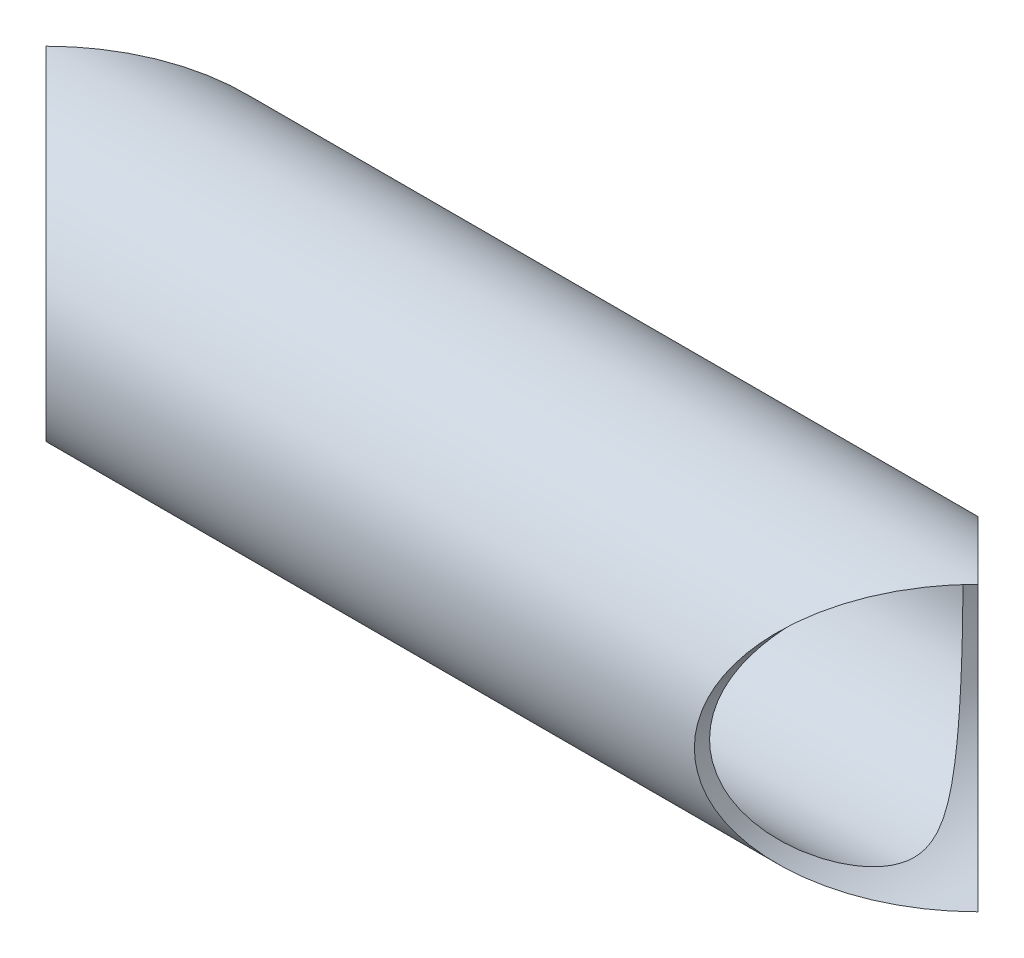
ISO-10303-21;
HEADER;
FILE_DESCRIPTION(('STEP AP214'),'2;1');
FILE_NAME('part.step','',(''),(''),'','','');
FILE_SCHEMA(('AUTOMOTIVE_DESIGN { 1 0 10303 214 1 1 1 1 }'));
ENDSEC;
DATA;
#1=APPLICATION_CONTEXT('core data for automotive mechanical design processes');
#2=APPLICATION_PROTOCOL_DEFINITION('international standard','automotive_design',2000,#1);
#3=PRODUCT_CONTEXT('',#1,'mechanical');
#4=PRODUCT('Part','Part','',(#3));
#5=PRODUCT_RELATED_PRODUCT_CATEGORY('part','',(#4));
#6=PRODUCT_DEFINITION_FORMATION('','',#4);
#7=PRODUCT_DEFINITION_CONTEXT('part definition',#1,'design');
#8=PRODUCT_DEFINITION('design','',#6,#7);
#9=PRODUCT_DEFINITION_SHAPE('','',#8);
#10=(LENGTH_UNIT() NAMED_UNIT(*) SI_UNIT(.MILLI.,.METRE.));
#11=(NAMED_UNIT(*) PLANE_ANGLE_UNIT() SI_UNIT($,.RADIAN.));
#12=(NAMED_UNIT(*) SI_UNIT($,.STERADIAN.) SOLID_ANGLE_UNIT());
#13=UNCERTAINTY_MEASURE_WITH_UNIT(LENGTH_MEASURE(1.E-05),#10,'distance_accuracy_value','');
#14=(GEOMETRIC_REPRESENTATION_CONTEXT(3) GLOBAL_UNCERTAINTY_ASSIGNED_CONTEXT((#13)) GLOBAL_UNIT_ASSIGNED_CONTEXT((#10,
#11,#12)) REPRESENTATION_CONTEXT('',''));
#15=CARTESIAN_POINT('',(0.,0.,0.));
#16=DIRECTION('',(0.,0.,1.));
#17=DIRECTION('',(1.,0.,0.));
#18=AXIS2_PLACEMENT_3D('',#15,#16,#17);
#19=CARTESIAN_POINT('',(-299.001,0.,-989.));
#20=DIRECTION('',(1.,0.,0.));
#21=DIRECTION('',(0.,0.,-1.));
#22=AXIS2_PLACEMENT_3D('',#19,#20,#21);
#23=CYLINDRICAL_SURFACE('',#22,13.9999999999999);
#24=CARTESIAN_POINT('',(-285.,0.,-989.));
#25=DIRECTION('',(0.707106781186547,0.,0.707106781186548));
#26=DIRECTION('',(0.707106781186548,0.,-0.707106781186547));
#27=AXIS2_PLACEMENT_3D('',#24,#25,#26);
#28=ELLIPSE('',#27,19.7989898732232,13.9999999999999);
#29=CARTESIAN_POINT('',(-285.,-14.,-989.));
#30=VERTEX_POINT('',#29);
#31=CARTESIAN_POINT('',(-285.,13.9999999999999,-989.));
#32=VERTEX_POINT('',#31);
#33=EDGE_CURVE('E42',#30,#32,#28,.T.);
#34=ORIENTED_EDGE('',*,*,#33,.T.);
#35=CARTESIAN_POINT('',(-285.,0.,-989.));
#36=DIRECTION('',(0.707106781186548,0.,-0.707106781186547));
#37=DIRECTION('',(0.707106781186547,0.,0.707106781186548));
#38=AXIS2_PLACEMENT_3D('',#35,#36,#37);
#39=ELLIPSE('',#38,19.7989898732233,13.9999999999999);
#40=EDGE_CURVE('E50',#32,#30,#39,.T.);
#41=ORIENTED_EDGE('',*,*,#40,.T.);
#42=EDGE_LOOP('',(#34,#41));
#43=FACE_BOUND('',#42,.T.);
#44=CARTESIAN_POINT('',(-193.,0.,-989.));
#45=DIRECTION('',(-0.707106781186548,0.,0.707106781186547));
#46=DIRECTION('',(-0.707106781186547,0.,-0.707106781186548));
#47=AXIS2_PLACEMENT_3D('',#44,#45,#46);
#48=ELLIPSE('',#47,19.7989898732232,13.9999999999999);
#49=CARTESIAN_POINT('',(-193.,13.9999999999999,-989.));
#50=VERTEX_POINT('',#49);
#51=CARTESIAN_POINT('',(-193.,-13.9999999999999,-989.));
#52=VERTEX_POINT('',#51);
#53=EDGE_CURVE('E61',#50,#52,#48,.T.);
#54=ORIENTED_EDGE('',*,*,#53,.T.);
#55=CARTESIAN_POINT('',(-193.,0.,-989.));
#56=DIRECTION('',(-0.707106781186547,0.,-0.707106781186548));
#57=DIRECTION('',(-0.707106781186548,0.,0.707106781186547));
#58=AXIS2_PLACEMENT_3D('',#55,#56,#57);
#59=ELLIPSE('',#58,19.7989898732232,13.9999999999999);
#60=EDGE_CURVE('E58',#52,#50,#59,.T.);
#61=ORIENTED_EDGE('',*,*,#60,.T.);
#62=EDGE_LOOP('',(#54,#61));
#63=FACE_BOUND('',#62,.T.);
#64=ADVANCED_FACE('F32',(#43,#63),#23,.T.);
#65=CARTESIAN_POINT('',(-299.001,0.,-989.));
#66=DIRECTION('',(1.,0.,0.));
#67=DIRECTION('',(0.,0.,-1.));
#68=AXIS2_PLACEMENT_3D('',#65,#66,#67);
#69=CYLINDRICAL_SURFACE('',#68,12.5);
#70=CARTESIAN_POINT('',(-271.,0.,-1001.5));
#71=CARTESIAN_POINT('',(-270.999997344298,0.290426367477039,-1001.50000268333));
#72=CARTESIAN_POINT('',(-271.009053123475,0.58082246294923,-1001.48986291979));
#73=CARTESIAN_POINT('',(-271.045065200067,1.15920550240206,-1001.44950961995));
#74=CARTESIAN_POINT('',(-271.072027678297,1.44719157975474,-1001.41928915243));
#75=CARTESIAN_POINT('',(-271.143297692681,2.01862087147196,-1001.33930822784));
#76=CARTESIAN_POINT('',(-271.187627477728,2.30205777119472,-1001.28952270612));
#77=CARTESIAN_POINT('',(-271.292675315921,2.86188119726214,-1001.17133856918));
#78=CARTESIAN_POINT('',(-271.353392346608,3.13826816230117,-1001.10294111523));
#79=CARTESIAN_POINT('',(-271.48955761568,3.6804294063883,-1000.94919739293));
#80=CARTESIAN_POINT('',(-271.564905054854,3.94626210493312,-1000.86396703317));
#81=CARTESIAN_POINT('',(-271.729248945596,4.46788012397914,-1000.67753271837));
#82=CARTESIAN_POINT('',(-271.818245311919,4.72366550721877,-1000.57632886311));
#83=CARTESIAN_POINT('',(-272.008479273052,5.22418119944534,-1000.35924058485));
#84=CARTESIAN_POINT('',(-272.109716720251,5.46891164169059,-1000.24335633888));
#85=CARTESIAN_POINT('',(-272.323025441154,5.94666222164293,-999.998151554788));
#86=CARTESIAN_POINT('',(-272.435099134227,6.17967972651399,-999.868828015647));
#87=CARTESIAN_POINT('',(-272.714725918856,6.72299041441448,-999.544530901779));
#88=CARTESIAN_POINT('',(-272.886739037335,7.02755432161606,-999.343767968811));
#89=CARTESIAN_POINT('',(-273.245510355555,7.61247576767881,-998.921214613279));
#90=CARTESIAN_POINT('',(-273.432273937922,7.89282439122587,-998.699416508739));
#91=CARTESIAN_POINT('',(-273.817512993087,8.42979199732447,-998.236586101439));
#92=CARTESIAN_POINT('',(-274.016013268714,8.68635755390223,-997.995512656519));
#93=CARTESIAN_POINT('',(-274.420991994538,9.17525653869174,-997.49627804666));
#94=CARTESIAN_POINT('',(-274.627469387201,9.40759316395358,-997.238119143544));
#95=CARTESIAN_POINT('',(-275.049824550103,9.85344692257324,-996.699647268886));
#96=CARTESIAN_POINT('',(-275.265809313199,10.0664134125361,-996.418963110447));
#97=CARTESIAN_POINT('',(-275.698739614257,10.4677435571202,-995.841064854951));
#98=CARTESIAN_POINT('',(-275.915685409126,10.6561001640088,-995.543846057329));
#99=CARTESIAN_POINT('',(-276.345299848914,11.0078643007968,-994.933038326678));
#100=CARTESIAN_POINT('',(-276.55797558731,11.1713168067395,-994.619480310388));
#101=CARTESIAN_POINT('',(-276.973085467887,11.4731979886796,-993.974194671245));
#102=CARTESIAN_POINT('',(-277.175526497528,11.61164365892,-993.642479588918));
#103=CARTESIAN_POINT('',(-277.465112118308,11.7999538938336,-993.128501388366));
#104=CARTESIAN_POINT('',(-277.559540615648,11.8596381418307,-992.953925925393));
#105=CARTESIAN_POINT('',(-277.741823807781,11.972065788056,-992.599211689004));
#106=CARTESIAN_POINT('',(-277.829677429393,12.0248080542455,-992.419072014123));
#107=CARTESIAN_POINT('',(-278.080383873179,12.1719422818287,-991.870033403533));
#108=CARTESIAN_POINT('',(-278.23073290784,12.2554639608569,-991.491918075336));
#109=CARTESIAN_POINT('',(-278.405289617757,12.3496272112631,-990.940068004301));
#110=CARTESIAN_POINT('',(-278.451939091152,12.3743714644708,-990.775680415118));
#111=CARTESIAN_POINT('',(-278.534135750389,12.4175173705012,-990.443364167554));
#112=CARTESIAN_POINT('',(-278.569688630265,12.4359222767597,-990.275437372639));
#113=CARTESIAN_POINT('',(-278.628151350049,12.4659792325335,-989.93709541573));
#114=CARTESIAN_POINT('',(-278.651084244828,12.4776435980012,-989.766685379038));
#115=CARTESIAN_POINT('',(-278.683281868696,12.4939746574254,-989.424230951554));
#116=CARTESIAN_POINT('',(-278.692547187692,12.4986416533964,-989.252186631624));
#117=CARTESIAN_POINT('',(-278.696924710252,12.5008499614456,-988.907247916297));
#118=CARTESIAN_POINT('',(-278.691985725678,12.4983655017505,-988.734352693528));
#119=CARTESIAN_POINT('',(-278.668112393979,12.4862873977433,-988.389793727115));
#120=CARTESIAN_POINT('',(-278.64917766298,12.476693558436,-988.218130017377));
#121=CARTESIAN_POINT('',(-278.598234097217,12.450630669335,-987.877005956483));
#122=CARTESIAN_POINT('',(-278.566202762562,12.4341497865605,-987.707549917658));
#123=CARTESIAN_POINT('',(-278.490498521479,12.3946846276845,-987.372008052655));
#124=CARTESIAN_POINT('',(-278.446821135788,12.3716978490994,-987.205923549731));
#125=CARTESIAN_POINT('',(-278.32587248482,12.3070190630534,-986.798152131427));
#126=CARTESIAN_POINT('',(-278.242578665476,12.2616606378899,-986.558830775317));
#127=CARTESIAN_POINT('',(-278.059203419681,12.1587985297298,-986.089424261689));
#128=CARTESIAN_POINT('',(-277.959111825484,12.1012874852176,-985.859344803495));
#129=CARTESIAN_POINT('',(-277.746243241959,11.9749067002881,-985.40738896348));
#130=CARTESIAN_POINT('',(-277.633423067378,11.9059978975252,-985.185544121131));
#131=CARTESIAN_POINT('',(-277.398923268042,11.75767349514,-984.750297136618));
#132=CARTESIAN_POINT('',(-277.277244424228,11.678258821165,-984.536894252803));
#133=CARTESIAN_POINT('',(-277.041252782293,11.5185240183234,-984.14055953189));
#134=CARTESIAN_POINT('',(-276.927571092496,11.4392350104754,-983.956832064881));
#135=CARTESIAN_POINT('',(-276.696794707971,11.2728455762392,-983.595134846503));
#136=CARTESIAN_POINT('',(-276.579699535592,11.1857440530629,-983.417165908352));
#137=CARTESIAN_POINT('',(-276.225061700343,10.9128047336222,-982.89124054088));
#138=CARTESIAN_POINT('',(-275.98425362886,10.715389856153,-982.551407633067));
#139=CARTESIAN_POINT('',(-275.501704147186,10.2900913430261,-981.892421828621));
#140=CARTESIAN_POINT('',(-275.259963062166,10.0622175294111,-981.573262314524));
#141=CARTESIAN_POINT('',(-274.781244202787,9.57566913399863,-980.955687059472));
#142=CARTESIAN_POINT('',(-274.544264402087,9.31700799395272,-980.657262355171));
#143=CARTESIAN_POINT('',(-274.120796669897,8.81650601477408,-980.132840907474));
#144=CARTESIAN_POINT('',(-273.932743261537,8.5796728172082,-979.903321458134));
#145=CARTESIAN_POINT('',(-273.565992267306,8.08445323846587,-979.460506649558));
#146=CARTESIAN_POINT('',(-273.387294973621,7.82606618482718,-979.247211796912));
#147=CARTESIAN_POINT('',(-273.042387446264,7.28816980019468,-978.838977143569));
#148=CARTESIAN_POINT('',(-272.876157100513,7.00869601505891,-978.644007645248));
#149=CARTESIAN_POINT('',(-272.55883832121,6.42858608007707,-978.274259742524));
#150=CARTESIAN_POINT('',(-272.40774598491,6.1279554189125,-978.099476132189));
#151=CARTESIAN_POINT('',(-272.154554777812,5.57370754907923,-977.808062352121));
#152=CARTESIAN_POINT('',(-272.048931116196,5.32400446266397,-977.687034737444));
#153=CARTESIAN_POINT('',(-271.850422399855,4.81287144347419,-977.460312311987));
#154=CARTESIAN_POINT('',(-271.757534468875,4.55144417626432,-977.354614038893));
#155=CARTESIAN_POINT('',(-271.586033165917,4.01795566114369,-977.159956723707));
#156=CARTESIAN_POINT('',(-271.507415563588,3.74589759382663,-977.070992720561));
#157=CARTESIAN_POINT('',(-271.365872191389,3.19250876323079,-976.911128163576));
#158=CARTESIAN_POINT('',(-271.302946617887,2.91117788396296,-976.840227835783));
#159=CARTESIAN_POINT('',(-271.19370060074,2.33911635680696,-976.717300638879));
#160=CARTESIAN_POINT('',(-271.147498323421,2.0483340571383,-976.665408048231));
#161=CARTESIAN_POINT('',(-271.073356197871,1.46152013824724,-976.582199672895));
#162=CARTESIAN_POINT('',(-271.045416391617,1.16548850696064,-976.550883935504));
#163=CARTESIAN_POINT('',(-271.008474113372,0.570876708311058,-976.509488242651));
#164=CARTESIAN_POINT('',(-270.99946434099,0.272297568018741,-976.499400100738));
#165=CARTESIAN_POINT('',(-271.000584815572,-0.32476440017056,-976.500654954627));
#166=CARTESIAN_POINT('',(-271.010713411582,-0.623247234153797,-976.511996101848));
#167=CARTESIAN_POINT('',(-271.047713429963,-1.18493817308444,-976.553459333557));
#168=CARTESIAN_POINT('',(-271.072637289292,-1.44844139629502,-976.581397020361));
#169=CARTESIAN_POINT('',(-271.136989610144,-1.97137774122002,-976.653610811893));
#170=CARTESIAN_POINT('',(-271.176416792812,-2.23081121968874,-976.697885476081));
#171=CARTESIAN_POINT('',(-271.269070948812,-2.74401080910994,-976.802091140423));
#172=CARTESIAN_POINT('',(-271.322299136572,-2.99777641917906,-976.862023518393));
#173=CARTESIAN_POINT('',(-271.441662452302,-3.49823864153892,-976.996688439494));
#174=CARTESIAN_POINT('',(-271.507798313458,-3.74493485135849,-977.071421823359));
#175=CARTESIAN_POINT('',(-271.654634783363,-4.23911744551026,-977.237757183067));
#176=CARTESIAN_POINT('',(-271.735784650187,-4.48629370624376,-977.329882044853));
#177=CARTESIAN_POINT('',(-271.909691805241,-4.97093045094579,-977.527928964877));
#178=CARTESIAN_POINT('',(-272.0024535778,-5.208387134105,-977.633856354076));
#179=CARTESIAN_POINT('',(-272.198318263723,-5.67278129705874,-977.858363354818));
#180=CARTESIAN_POINT('',(-272.301420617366,-5.89971934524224,-977.976942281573));
#181=CARTESIAN_POINT('',(-272.516755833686,-6.34265635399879,-978.22571298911));
#182=CARTESIAN_POINT('',(-272.628990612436,-6.55865300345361,-978.355907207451));
#183=CARTESIAN_POINT('',(-272.920288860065,-7.08601843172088,-978.695608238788));
#184=CARTESIAN_POINT('',(-273.10440537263,-7.39027375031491,-978.911883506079));
#185=CARTESIAN_POINT('',(-273.48680172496,-7.97294254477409,-979.365753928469));
#186=CARTESIAN_POINT('',(-273.685087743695,-8.25134462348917,-979.603358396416));
#187=CARTESIAN_POINT('',(-274.092711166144,-8.78314332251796,-980.09838426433));
#188=CARTESIAN_POINT('',(-274.302080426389,-9.03646110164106,-980.355863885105));
#189=CARTESIAN_POINT('',(-274.727599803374,-9.51739803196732,-980.888411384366));
#190=CARTESIAN_POINT('',(-274.94374866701,-9.7450218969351,-981.163476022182));
#191=CARTESIAN_POINT('',(-275.384032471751,-10.1799336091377,-981.736980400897));
#192=CARTESIAN_POINT('',(-275.608236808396,-10.3866342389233,-982.035811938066));
#193=CARTESIAN_POINT('',(-276.055110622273,-10.7738755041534,-982.651306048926));
#194=CARTESIAN_POINT('',(-276.277779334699,-10.9544038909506,-982.96797687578));
#195=CARTESIAN_POINT('',(-276.714842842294,-11.2885523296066,-983.619271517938));
#196=CARTESIAN_POINT('',(-276.929259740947,-11.4422488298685,-983.953840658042));
#197=CARTESIAN_POINT('',(-277.238471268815,-11.6522223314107,-984.471177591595));
#198=CARTESIAN_POINT('',(-277.339440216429,-11.7187656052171,-984.646140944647));
#199=CARTESIAN_POINT('',(-277.535767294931,-11.8447793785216,-985.001652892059));
#200=CARTESIAN_POINT('',(-277.631126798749,-11.9042516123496,-985.182200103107));
#201=CARTESIAN_POINT('',(-277.806083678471,-12.0107071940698,-985.532537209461));
#202=CARTESIAN_POINT('',(-277.88632551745,-12.0583347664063,-985.70180789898));
#203=CARTESIAN_POINT('',(-278.039029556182,-12.1471268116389,-986.045542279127));
#204=CARTESIAN_POINT('',(-278.111490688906,-12.1882903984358,-986.22000667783));
#205=CARTESIAN_POINT('',(-278.246524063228,-12.2636264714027,-986.573866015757));
#206=CARTESIAN_POINT('',(-278.309113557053,-12.2978111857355,-986.753251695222));
#207=CARTESIAN_POINT('',(-278.422304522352,-12.3587241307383,-987.116946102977));
#208=CARTESIAN_POINT('',(-278.472913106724,-12.385456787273,-987.301251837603));
#209=CARTESIAN_POINT('',(-278.553624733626,-12.4276310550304,-987.647288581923));
#210=CARTESIAN_POINT('',(-278.585632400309,-12.4441450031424,-987.808442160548));
#211=CARTESIAN_POINT('',(-278.637934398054,-12.4709659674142,-988.133100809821));
#212=CARTESIAN_POINT('',(-278.658234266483,-12.4812759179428,-988.296604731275));
#213=CARTESIAN_POINT('',(-278.686203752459,-12.4954482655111,-988.624855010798));
#214=CARTESIAN_POINT('',(-278.69388309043,-12.4993156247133,-988.789600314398));
#215=CARTESIAN_POINT('',(-278.696266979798,-12.5005180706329,-989.11921193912));
#216=CARTESIAN_POINT('',(-278.690971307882,-12.4978530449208,-989.284078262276));
#217=CARTESIAN_POINT('',(-278.667688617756,-12.4860722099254,-989.612291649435));
#218=CARTESIAN_POINT('',(-278.649730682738,-12.4769711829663,-989.775641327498));
#219=CARTESIAN_POINT('',(-278.60199002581,-12.4525569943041,-990.100158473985));
#220=CARTESIAN_POINT('',(-278.572202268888,-12.4372411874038,-990.261324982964));
#221=CARTESIAN_POINT('',(-278.466791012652,-12.382386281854,-990.740651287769));
#222=CARTESIAN_POINT('',(-278.375143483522,-12.333950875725,-991.054350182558));
#223=CARTESIAN_POINT('',(-278.174240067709,-12.2237604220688,-991.627559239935));
#224=CARTESIAN_POINT('',(-278.068665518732,-12.1644574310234,-991.888912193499));
#225=CARTESIAN_POINT('',(-277.840364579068,-12.0315043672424,-992.400398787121));
#226=CARTESIAN_POINT('',(-277.71762456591,-11.9578428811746,-992.650523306));
#227=CARTESIAN_POINT('',(-277.459818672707,-11.7969842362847,-993.141022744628));
#228=CARTESIAN_POINT('',(-277.324707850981,-11.7097368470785,-993.381357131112));
#229=CARTESIAN_POINT('',(-277.046533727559,-11.5226093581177,-993.852173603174));
#230=CARTESIAN_POINT('',(-276.903471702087,-11.4227312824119,-994.082657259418));
#231=CARTESIAN_POINT('',(-276.518040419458,-11.1420018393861,-994.681131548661));
#232=CARTESIAN_POINT('',(-276.271384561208,-10.95061457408,-995.041460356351));
#233=CARTESIAN_POINT('',(-275.774070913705,-10.5350627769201,-995.73999764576));
#234=CARTESIAN_POINT('',(-275.523410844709,-10.3108789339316,-996.078192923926));
#235=CARTESIAN_POINT('',(-275.025401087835,-9.82990761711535,-996.732233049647));
#236=CARTESIAN_POINT('',(-274.778047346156,-9.5731650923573,-997.048107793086));
#237=CARTESIAN_POINT('',(-274.292177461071,-9.02641851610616,-997.656846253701));
#238=CARTESIAN_POINT('',(-274.053656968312,-8.73643112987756,-997.949721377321));
#239=CARTESIAN_POINT('',(-273.649266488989,-8.20020867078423,-998.439440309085));
#240=CARTESIAN_POINT('',(-273.480258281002,-7.96141219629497,-998.641860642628));
#241=CARTESIAN_POINT('',(-273.152453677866,-7.46485921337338,-999.031221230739));
#242=CARTESIAN_POINT('',(-272.993657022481,-7.20710318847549,-999.218161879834));
#243=CARTESIAN_POINT('',(-272.688866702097,-6.67311106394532,-999.574616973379));
#244=CARTESIAN_POINT('',(-272.542859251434,-6.39689544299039,-999.744150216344));
#245=CARTESIAN_POINT('',(-272.266002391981,-5.82630169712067,-1000.06395496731));
#246=CARTESIAN_POINT('',(-272.135149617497,-5.53192762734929,-1000.21423075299));
#247=CARTESIAN_POINT('',(-271.914011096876,-4.98271227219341,-1000.46717624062));
#248=CARTESIAN_POINT('',(-271.820713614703,-4.73075971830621,-1000.57349481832));
#249=CARTESIAN_POINT('',(-271.647288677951,-4.21647994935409,-1000.77060298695));
#250=CARTESIAN_POINT('',(-271.56715853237,-3.95415486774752,-1000.86139575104));
#251=CARTESIAN_POINT('',(-271.421529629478,-3.42073720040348,-1001.0260688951));
#252=CARTESIAN_POINT('',(-271.356008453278,-3.14965878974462,-1001.09997519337));
#253=CARTESIAN_POINT('',(-271.240692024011,-2.60005209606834,-1001.22985885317));
#254=CARTESIAN_POINT('',(-271.190891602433,-2.3215262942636,-1001.28584210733));
#255=CARTESIAN_POINT('',(-271.100170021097,-1.7055816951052,-1001.38773251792));
#256=CARTESIAN_POINT('',(-271.062710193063,-1.36698843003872,-1001.42973074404));
#257=CARTESIAN_POINT('',(-271.012624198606,-0.685583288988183,-1001.48586576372));
#258=CARTESIAN_POINT('',(-271.000003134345,-0.342770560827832,-1001.49999683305));
#259=CARTESIAN_POINT('',(-271.,0.,-1001.5));
#260=B_SPLINE_CURVE_WITH_KNOTS('',3,(#70,#71,#72,#73,#74,#75,#76,#77,#78,#79,#80,#81,#82,#83,
#84,#85,#86,#87,#88,#89,#90,#91,#92,#93,#94,#95,#96,#97,#98,#99,#100,#101,#102,#103,#104,#105,
#106,#107,#108,#109,#110,#111,#112,#113,#114,#115,#116,#117,#118,#119,#120,#121,#122,#123,#124,
#125,#126,#127,#128,#129,#130,#131,#132,#133,#134,#135,#136,#137,#138,#139,#140,#141,#142,#143,
#144,#145,#146,#147,#148,#149,#150,#151,#152,#153,#154,#155,#156,#157,#158,#159,#160,#161,#162,
#163,#164,#165,#166,#167,#168,#169,#170,#171,#172,#173,#174,#175,#176,#177,#178,#179,#180,#181,
#182,#183,#184,#185,#186,#187,#188,#189,#190,#191,#192,#193,#194,#195,#196,#197,#198,#199,#200,
#201,#202,#203,#204,#205,#206,#207,#208,#209,#210,#211,#212,#213,#214,#215,#216,#217,#218,#219,
#220,#221,#222,#223,#224,#225,#226,#227,#228,#229,#230,#231,#232,#233,#234,#235,#236,#237,#238,
#239,#240,#241,#242,#243,#244,#245,#246,#247,#248,#249,#250,#251,#252,#253,#254,#255,#256,#257,
#258,#259),.UNSPECIFIED.,.T.,.F.,(4,2,2,2,2,2,2,2,2,2,2,2,2,2,2,2,2,2,2,2,2,2,2,2,2,2,2,2,2,2,2,
2,2,2,2,2,2,2,2,2,2,2,2,2,2,2,2,2,2,2,2,2,2,2,2,2,2,2,2,2,2,2,2,2,2,2,2,2,2,2,2,2,2,2,2,2,2,2,2,
2,2,2,2,2,2,2,2,2,2,2,2,2,2,2,4),(0.,0.870912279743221,1.74212532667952,2.61445813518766,
3.48673652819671,4.35320575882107,5.21966957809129,6.08612295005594,6.9527702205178,
8.16090249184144,9.3694776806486,10.5807051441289,11.791772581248,13.0304845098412,
14.2695504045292,15.5063513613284,16.7423086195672,17.3637986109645,17.9853898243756,
19.2264014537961,19.743988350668,20.2613092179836,20.7776818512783,21.2940321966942,
21.8122456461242,22.33047330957,22.8495950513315,23.3689167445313,24.1398997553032,
24.9113511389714,25.6855034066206,26.459587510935,27.14976932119,27.8400481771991,
29.2211329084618,30.6017733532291,31.9818132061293,33.1197908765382,34.2578040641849,
35.3939400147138,36.5297822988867,37.419696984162,38.3094103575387,39.1988595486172,
40.0883198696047,40.9839477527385,41.8795776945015,42.7748621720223,43.6700694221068,
44.4675924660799,45.2650452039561,46.0625681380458,46.8601363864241,47.6872891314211,
48.5147623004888,49.3421907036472,50.169793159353,51.4166243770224,52.6640026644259,
53.9151847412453,55.1661369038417,56.4458234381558,57.7261069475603,59.0026809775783,
59.6405294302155,60.2782211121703,60.8577961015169,61.4374504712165,62.0160803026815,
62.5943657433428,63.0892563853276,63.5839127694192,64.0781879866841,64.5724717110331,
65.0656238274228,65.5589860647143,66.5465675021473,67.4095272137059,68.2731756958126,
69.1400966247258,70.0068788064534,71.4352569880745,72.8644796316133,74.2917502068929,
75.7183084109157,76.7846947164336,77.8510538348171,78.9162489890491,79.9812071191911,
80.8472084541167,81.7130325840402,82.5775187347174,83.4417203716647,84.4693880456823,
85.4972667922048),.UNSPECIFIED.);
#261=CARTESIAN_POINT('',(-271.,0.,-1001.5));
#262=VERTEX_POINT('',#261);
#263=EDGE_CURVE('E11',#262,#262,#260,.T.);
#264=ORIENTED_EDGE('',*,*,#263,.F.);
#265=EDGE_LOOP('',(#264));
#266=FACE_BOUND('',#265,.T.);
#267=CARTESIAN_POINT('',(-207.,0.,-976.5));
#268=CARTESIAN_POINT('',(-207.000002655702,0.290426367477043,-976.499997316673));
#269=CARTESIAN_POINT('',(-206.990946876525,0.580822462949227,-976.510137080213));
#270=CARTESIAN_POINT('',(-206.954934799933,1.15920550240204,-976.550490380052));
#271=CARTESIAN_POINT('',(-206.927972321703,1.44719157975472,-976.580710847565));
#272=CARTESIAN_POINT('',(-206.856702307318,2.01862087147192,-976.660691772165));
#273=CARTESIAN_POINT('',(-206.812372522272,2.30205777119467,-976.710477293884));
#274=CARTESIAN_POINT('',(-206.707324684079,2.8618811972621,-976.828661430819));
#275=CARTESIAN_POINT('',(-206.646607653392,3.13826816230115,-976.897058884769));
#276=CARTESIAN_POINT('',(-206.51044238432,3.68042940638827,-977.050802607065));
#277=CARTESIAN_POINT('',(-206.435094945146,3.94626210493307,-977.136032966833));
#278=CARTESIAN_POINT('',(-206.270751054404,4.46788012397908,-977.322467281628));
#279=CARTESIAN_POINT('',(-206.181754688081,4.72366550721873,-977.423671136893));
#280=CARTESIAN_POINT('',(-205.991520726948,5.22418119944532,-977.640759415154));
#281=CARTESIAN_POINT('',(-205.890283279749,5.46891164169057,-977.756643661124));
#282=CARTESIAN_POINT('',(-205.676974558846,5.9466622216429,-978.001848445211));
#283=CARTESIAN_POINT('',(-205.564900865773,6.17967972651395,-978.131171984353));
#284=CARTESIAN_POINT('',(-205.285274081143,6.72299041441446,-978.455469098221));
#285=CARTESIAN_POINT('',(-205.113260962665,7.02755432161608,-978.656232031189));
#286=CARTESIAN_POINT('',(-204.754489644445,7.61247576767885,-979.078785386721));
#287=CARTESIAN_POINT('',(-204.567726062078,7.8928243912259,-979.30058349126));
#288=CARTESIAN_POINT('',(-204.182487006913,8.42979199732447,-979.763413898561));
#289=CARTESIAN_POINT('',(-203.983986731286,8.68635755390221,-980.004487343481));
#290=CARTESIAN_POINT('',(-203.579008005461,9.17525653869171,-980.50372195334));
#291=CARTESIAN_POINT('',(-203.372530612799,9.40759316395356,-980.761880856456));
#292=CARTESIAN_POINT('',(-202.950175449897,9.85344692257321,-981.300352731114));
#293=CARTESIAN_POINT('',(-202.734190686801,10.0664134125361,-981.581036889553));
#294=CARTESIAN_POINT('',(-202.301260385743,10.4677435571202,-982.158935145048));
#295=CARTESIAN_POINT('',(-202.084314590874,10.6561001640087,-982.456153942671));
#296=CARTESIAN_POINT('',(-201.654700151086,11.0078643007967,-983.066961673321));
#297=CARTESIAN_POINT('',(-201.44202441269,11.1713168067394,-983.380519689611));
#298=CARTESIAN_POINT('',(-201.026914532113,11.4731979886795,-984.025805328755));
#299=CARTESIAN_POINT('',(-200.824473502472,11.6116436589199,-984.357520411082));
#300=CARTESIAN_POINT('',(-200.534887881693,11.7999538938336,-984.871498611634));
#301=CARTESIAN_POINT('',(-200.440459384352,11.8596381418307,-985.046074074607));
#302=CARTESIAN_POINT('',(-200.258176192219,11.972065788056,-985.400788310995));
#303=CARTESIAN_POINT('',(-200.170322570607,12.0248080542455,-985.580927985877));
#304=CARTESIAN_POINT('',(-199.919616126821,12.1719422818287,-986.129966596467));
#305=CARTESIAN_POINT('',(-199.76926709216,12.2554639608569,-986.508081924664));
#306=CARTESIAN_POINT('',(-199.594710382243,12.3496272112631,-987.059931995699));
#307=CARTESIAN_POINT('',(-199.548060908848,12.3743714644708,-987.224319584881));
#308=CARTESIAN_POINT('',(-199.465864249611,12.4175173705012,-987.556635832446));
#309=CARTESIAN_POINT('',(-199.430311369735,12.4359222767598,-987.724562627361));
#310=CARTESIAN_POINT('',(-199.371848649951,12.4659792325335,-988.06290458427));
#311=CARTESIAN_POINT('',(-199.348915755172,12.4776435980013,-988.233314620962));
#312=CARTESIAN_POINT('',(-199.316718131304,12.4939746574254,-988.575769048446));
#313=CARTESIAN_POINT('',(-199.307452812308,12.4986416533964,-988.747813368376));
#314=CARTESIAN_POINT('',(-199.303075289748,12.5008499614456,-989.092752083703));
#315=CARTESIAN_POINT('',(-199.308014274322,12.4983655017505,-989.265647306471));
#316=CARTESIAN_POINT('',(-199.331887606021,12.4862873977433,-989.610206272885));
#317=CARTESIAN_POINT('',(-199.35082233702,12.476693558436,-989.781869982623));
#318=CARTESIAN_POINT('',(-199.401765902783,12.450630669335,-990.122994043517));
#319=CARTESIAN_POINT('',(-199.433797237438,12.4341497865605,-990.292450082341));
#320=CARTESIAN_POINT('',(-199.509501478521,12.3946846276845,-990.627991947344));
#321=CARTESIAN_POINT('',(-199.553178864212,12.3716978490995,-990.794076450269));
#322=CARTESIAN_POINT('',(-199.67412751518,12.3070190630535,-991.201847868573));
#323=CARTESIAN_POINT('',(-199.757421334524,12.2616606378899,-991.441169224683));
#324=CARTESIAN_POINT('',(-199.940796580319,12.1587985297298,-991.91057573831));
#325=CARTESIAN_POINT('',(-200.040888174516,12.1012874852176,-992.140655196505));
#326=CARTESIAN_POINT('',(-200.253756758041,11.9749067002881,-992.592611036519));
#327=CARTESIAN_POINT('',(-200.366576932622,11.9059978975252,-992.814455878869));
#328=CARTESIAN_POINT('',(-200.601076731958,11.75767349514,-993.249702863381));
#329=CARTESIAN_POINT('',(-200.722755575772,11.678258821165,-993.463105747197));
#330=CARTESIAN_POINT('',(-200.958747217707,11.5185240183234,-993.859440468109));
#331=CARTESIAN_POINT('',(-201.072428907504,11.4392350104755,-994.043167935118));
#332=CARTESIAN_POINT('',(-201.303205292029,11.2728455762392,-994.404865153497));
#333=CARTESIAN_POINT('',(-201.420300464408,11.1857440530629,-994.582834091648));
#334=CARTESIAN_POINT('',(-201.774938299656,10.9128047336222,-995.108759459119));
#335=CARTESIAN_POINT('',(-202.01574637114,10.715389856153,-995.448592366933));
#336=CARTESIAN_POINT('',(-202.498295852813,10.2900913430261,-996.107578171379));
#337=CARTESIAN_POINT('',(-202.740036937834,10.0622175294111,-996.426737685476));
#338=CARTESIAN_POINT('',(-203.218755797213,9.57566913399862,-997.044312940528));
#339=CARTESIAN_POINT('',(-203.455735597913,9.31700799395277,-997.342737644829));
#340=CARTESIAN_POINT('',(-203.879203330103,8.81650601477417,-997.867159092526));
#341=CARTESIAN_POINT('',(-204.067256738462,8.57967281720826,-998.096678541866));
#342=CARTESIAN_POINT('',(-204.434007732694,8.08445323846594,-998.539493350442));
#343=CARTESIAN_POINT('',(-204.612705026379,7.82606618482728,-998.752788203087));
#344=CARTESIAN_POINT('',(-204.957612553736,7.28816980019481,-999.161022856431));
#345=CARTESIAN_POINT('',(-205.123842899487,7.00869601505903,-999.355992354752));
#346=CARTESIAN_POINT('',(-205.44116167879,6.42858608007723,-999.725740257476));
#347=CARTESIAN_POINT('',(-205.592254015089,6.1279554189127,-999.900523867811));
#348=CARTESIAN_POINT('',(-205.845445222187,5.57370754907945,-1000.19193764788));
#349=CARTESIAN_POINT('',(-205.951068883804,5.32400446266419,-1000.31296526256));
#350=CARTESIAN_POINT('',(-206.149577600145,4.81287144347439,-1000.53968768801));
#351=CARTESIAN_POINT('',(-206.242465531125,4.55144417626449,-1000.64538596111));
#352=CARTESIAN_POINT('',(-206.413966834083,4.01795566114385,-1000.84004327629));
#353=CARTESIAN_POINT('',(-206.492584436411,3.74589759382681,-1000.92900727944));
#354=CARTESIAN_POINT('',(-206.634127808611,3.19250876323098,-1001.08887183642));
#355=CARTESIAN_POINT('',(-206.697053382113,2.91117788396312,-1001.15977216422));
#356=CARTESIAN_POINT('',(-206.80629939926,2.3391163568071,-1001.28269936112));
#357=CARTESIAN_POINT('',(-206.852501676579,2.04833405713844,-1001.33459195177));
#358=CARTESIAN_POINT('',(-206.926643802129,1.46152013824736,-1001.4178003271));
#359=CARTESIAN_POINT('',(-206.954583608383,1.16548850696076,-1001.4491160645));
#360=CARTESIAN_POINT('',(-206.991525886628,0.570876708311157,-1001.49051175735));
#361=CARTESIAN_POINT('',(-207.00053565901,0.272297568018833,-1001.50059989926));
#362=CARTESIAN_POINT('',(-206.999415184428,-0.324764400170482,-1001.49934504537));
#363=CARTESIAN_POINT('',(-206.989286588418,-0.623247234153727,-1001.48800389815));
#364=CARTESIAN_POINT('',(-206.952286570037,-1.18493817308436,-1001.44654066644));
#365=CARTESIAN_POINT('',(-206.927362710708,-1.44844139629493,-1001.41860297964));
#366=CARTESIAN_POINT('',(-206.863010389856,-1.9713777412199,-1001.34638918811));
#367=CARTESIAN_POINT('',(-206.823583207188,-2.23081121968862,-1001.30211452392));
#368=CARTESIAN_POINT('',(-206.730929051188,-2.74401080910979,-1001.19790885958));
#369=CARTESIAN_POINT('',(-206.677700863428,-2.99777641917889,-1001.13797648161));
#370=CARTESIAN_POINT('',(-206.558337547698,-3.49823864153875,-1001.00331156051));
#371=CARTESIAN_POINT('',(-206.492201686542,-3.74493485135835,-1000.92857817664));
#372=CARTESIAN_POINT('',(-206.345365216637,-4.23911744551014,-1000.76224281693));
#373=CARTESIAN_POINT('',(-206.264215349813,-4.48629370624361,-1000.67011795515));
#374=CARTESIAN_POINT('',(-206.090308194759,-4.9709304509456,-1000.47207103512));
#375=CARTESIAN_POINT('',(-205.9975464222,-5.20838713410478,-1000.36614364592));
#376=CARTESIAN_POINT('',(-205.801681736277,-5.67278129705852,-1000.14163664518));
#377=CARTESIAN_POINT('',(-205.698579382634,-5.89971934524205,-1000.02305771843));
#378=CARTESIAN_POINT('',(-205.483244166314,-6.34265635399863,-999.77428701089));
#379=CARTESIAN_POINT('',(-205.371009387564,-6.55865300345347,-999.644092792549));
#380=CARTESIAN_POINT('',(-205.079711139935,-7.0860184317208,-999.304391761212));
#381=CARTESIAN_POINT('',(-204.89559462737,-7.39027375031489,-999.08811649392));
#382=CARTESIAN_POINT('',(-204.51319827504,-7.97294254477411,-998.634246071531));
#383=CARTESIAN_POINT('',(-204.314912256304,-8.25134462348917,-998.396641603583));
#384=CARTESIAN_POINT('',(-203.907288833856,-8.78314332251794,-997.901615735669));
#385=CARTESIAN_POINT('',(-203.697919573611,-9.03646110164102,-997.644136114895));
#386=CARTESIAN_POINT('',(-203.272400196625,-9.51739803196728,-997.111588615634));
#387=CARTESIAN_POINT('',(-203.056251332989,-9.74502189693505,-996.836523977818));
#388=CARTESIAN_POINT('',(-202.615967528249,-10.1799336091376,-996.263019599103));
#389=CARTESIAN_POINT('',(-202.391763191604,-10.3866342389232,-995.964188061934));
#390=CARTESIAN_POINT('',(-201.944889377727,-10.7738755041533,-995.348693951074));
#391=CARTESIAN_POINT('',(-201.722220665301,-10.9544038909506,-995.03202312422));
#392=CARTESIAN_POINT('',(-201.285157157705,-11.2885523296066,-994.380728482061));
#393=CARTESIAN_POINT('',(-201.070740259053,-11.4422488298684,-994.046159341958));
#394=CARTESIAN_POINT('',(-200.761528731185,-11.6522223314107,-993.528822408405));
#395=CARTESIAN_POINT('',(-200.660559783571,-11.718765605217,-993.353859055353));
#396=CARTESIAN_POINT('',(-200.464232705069,-11.8447793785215,-992.998347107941));
#397=CARTESIAN_POINT('',(-200.36887320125,-11.9042516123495,-992.817799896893));
#398=CARTESIAN_POINT('',(-200.193916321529,-12.0107071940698,-992.467462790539));
#399=CARTESIAN_POINT('',(-200.11367448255,-12.0583347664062,-992.29819210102));
#400=CARTESIAN_POINT('',(-199.960970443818,-12.1471268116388,-991.954457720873));
#401=CARTESIAN_POINT('',(-199.888509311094,-12.1882903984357,-991.779993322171));
#402=CARTESIAN_POINT('',(-199.753475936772,-12.2636264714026,-991.426133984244));
#403=CARTESIAN_POINT('',(-199.690886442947,-12.2978111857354,-991.246748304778));
#404=CARTESIAN_POINT('',(-199.577695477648,-12.3587241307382,-990.883053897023));
#405=CARTESIAN_POINT('',(-199.527086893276,-12.385456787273,-990.698748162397));
#406=CARTESIAN_POINT('',(-199.446375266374,-12.4276310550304,-990.352711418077));
#407=CARTESIAN_POINT('',(-199.41436759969,-12.4441450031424,-990.191557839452));
#408=CARTESIAN_POINT('',(-199.362065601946,-12.4709659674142,-989.866899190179));
#409=CARTESIAN_POINT('',(-199.341765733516,-12.4812759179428,-989.703395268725));
#410=CARTESIAN_POINT('',(-199.313796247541,-12.4954482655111,-989.375144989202));
#411=CARTESIAN_POINT('',(-199.30611690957,-12.4993156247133,-989.210399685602));
#412=CARTESIAN_POINT('',(-199.303733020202,-12.5005180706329,-988.88078806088));
#413=CARTESIAN_POINT('',(-199.309028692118,-12.4978530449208,-988.715921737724));
#414=CARTESIAN_POINT('',(-199.332311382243,-12.4860722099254,-988.387708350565));
#415=CARTESIAN_POINT('',(-199.350269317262,-12.4769711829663,-988.224358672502));
#416=CARTESIAN_POINT('',(-199.39800997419,-12.4525569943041,-987.899841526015));
#417=CARTESIAN_POINT('',(-199.427797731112,-12.4372411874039,-987.738675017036));
#418=CARTESIAN_POINT('',(-199.533208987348,-12.3823862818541,-987.259348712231));
#419=CARTESIAN_POINT('',(-199.624856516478,-12.333950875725,-986.945649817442));
#420=CARTESIAN_POINT('',(-199.82575993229,-12.2237604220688,-986.372440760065));
#421=CARTESIAN_POINT('',(-199.931334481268,-12.1644574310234,-986.111087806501));
#422=CARTESIAN_POINT('',(-200.159635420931,-12.0315043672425,-985.599601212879));
#423=CARTESIAN_POINT('',(-200.28237543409,-11.9578428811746,-985.349476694));
#424=CARTESIAN_POINT('',(-200.540181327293,-11.7969842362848,-984.858977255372));
#425=CARTESIAN_POINT('',(-200.675292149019,-11.7097368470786,-984.618642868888));
#426=CARTESIAN_POINT('',(-200.95346627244,-11.5226093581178,-984.147826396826));
#427=CARTESIAN_POINT('',(-201.096528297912,-11.4227312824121,-983.917342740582));
#428=CARTESIAN_POINT('',(-201.481959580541,-11.1420018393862,-983.318868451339));
#429=CARTESIAN_POINT('',(-201.728615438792,-10.9506145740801,-982.958539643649));
#430=CARTESIAN_POINT('',(-202.225929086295,-10.5350627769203,-982.26000235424));
#431=CARTESIAN_POINT('',(-202.476589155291,-10.3108789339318,-981.921807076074));
#432=CARTESIAN_POINT('',(-202.974598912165,-9.82990761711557,-981.267766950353));
#433=CARTESIAN_POINT('',(-203.221952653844,-9.57316509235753,-980.951892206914));
#434=CARTESIAN_POINT('',(-203.707822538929,-9.02641851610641,-980.343153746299));
#435=CARTESIAN_POINT('',(-203.946343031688,-8.7364311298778,-980.050278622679));
#436=CARTESIAN_POINT('',(-204.350733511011,-8.20020867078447,-979.560559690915));
#437=CARTESIAN_POINT('',(-204.519741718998,-7.96141219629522,-979.358139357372));
#438=CARTESIAN_POINT('',(-204.847546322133,-7.46485921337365,-978.968778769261));
#439=CARTESIAN_POINT('',(-205.006342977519,-7.20710318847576,-978.781838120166));
#440=CARTESIAN_POINT('',(-205.311133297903,-6.6731110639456,-978.425383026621));
#441=CARTESIAN_POINT('',(-205.457140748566,-6.39689544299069,-978.255849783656));
#442=CARTESIAN_POINT('',(-205.733997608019,-5.82630169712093,-977.936045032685));
#443=CARTESIAN_POINT('',(-205.864850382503,-5.53192762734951,-977.78576924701));
#444=CARTESIAN_POINT('',(-206.085988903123,-4.98271227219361,-977.532823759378));
#445=CARTESIAN_POINT('',(-206.179286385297,-4.73075971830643,-977.426505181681));
#446=CARTESIAN_POINT('',(-206.352711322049,-4.21647994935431,-977.229397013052));
#447=CARTESIAN_POINT('',(-206.43284146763,-3.95415486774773,-977.138604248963));
#448=CARTESIAN_POINT('',(-206.578470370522,-3.42073720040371,-976.973931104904));
#449=CARTESIAN_POINT('',(-206.643991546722,-3.14965878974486,-976.900024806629));
#450=CARTESIAN_POINT('',(-206.759307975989,-2.60005209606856,-976.770141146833));
#451=CARTESIAN_POINT('',(-206.809108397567,-2.32152629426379,-976.714157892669));
#452=CARTESIAN_POINT('',(-206.899829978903,-1.70558169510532,-976.61226748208));
#453=CARTESIAN_POINT('',(-206.937289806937,-1.36698843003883,-976.570269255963));
#454=CARTESIAN_POINT('',(-206.987375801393,-0.685583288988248,-976.514134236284));
#455=CARTESIAN_POINT('',(-206.999996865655,-0.342770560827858,-976.500003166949));
#456=CARTESIAN_POINT('',(-207.,0.,-976.5));
#457=B_SPLINE_CURVE_WITH_KNOTS('',3,(#267,#268,#269,#270,#271,#272,#273,#274,#275,#276,#277,
#278,#279,#280,#281,#282,#283,#284,#285,#286,#287,#288,#289,#290,#291,#292,#293,#294,#295,#296,
#297,#298,#299,#300,#301,#302,#303,#304,#305,#306,#307,#308,#309,#310,#311,#312,#313,#314,#315,
#316,#317,#318,#319,#320,#321,#322,#323,#324,#325,#326,#327,#328,#329,#330,#331,#332,#333,#334,
#335,#336,#337,#338,#339,#340,#341,#342,#343,#344,#345,#346,#347,#348,#349,#350,#351,#352,#353,
#354,#355,#356,#357,#358,#359,#360,#361,#362,#363,#364,#365,#366,#367,#368,#369,#370,#371,#372,
#373,#374,#375,#376,#377,#378,#379,#380,#381,#382,#383,#384,#385,#386,#387,#388,#389,#390,#391,
#392,#393,#394,#395,#396,#397,#398,#399,#400,#401,#402,#403,#404,#405,#406,#407,#408,#409,#410,
#411,#412,#413,#414,#415,#416,#417,#418,#419,#420,#421,#422,#423,#424,#425,#426,#427,#428,#429,
#430,#431,#432,#433,#434,#435,#436,#437,#438,#439,#440,#441,#442,#443,#444,#445,#446,#447,#448,
#449,#450,#451,#452,#453,#454,#455,#456),.UNSPECIFIED.,.T.,.F.,(4,2,2,2,2,2,2,2,2,2,2,2,2,2,2,2,
2,2,2,2,2,2,2,2,2,2,2,2,2,2,2,2,2,2,2,2,2,2,2,2,2,2,2,2,2,2,2,2,2,2,2,2,2,2,2,2,2,2,2,2,2,2,2,2,
2,2,2,2,2,2,2,2,2,2,2,2,2,2,2,2,2,2,2,2,2,2,2,2,2,2,2,2,2,2,4),(0.,0.870912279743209,
1.7421253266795,2.61445813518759,3.48673652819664,4.35320575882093,5.21966957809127,
6.08612295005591,6.95277022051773,8.16090249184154,9.36947768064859,10.5807051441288,
11.791772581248,13.0304845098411,14.269550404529,15.5063513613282,16.7423086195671,
17.3637986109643,17.9853898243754,19.2264014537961,19.743988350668,20.2613092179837,
20.7776818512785,21.2940321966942,21.8122456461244,22.3304733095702,22.8495950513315,
23.3689167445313,24.1398997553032,24.9113511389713,25.6855034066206,26.459587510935,
27.14976932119,27.8400481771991,29.2211329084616,30.6017733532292,31.9818132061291,
33.119790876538,34.2578040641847,35.3939400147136,36.5297822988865,37.4196969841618,
38.3094103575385,39.198859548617,40.0883198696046,40.9839477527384,41.8795776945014,
42.7748621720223,43.6700694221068,44.4675924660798,45.2650452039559,46.0625681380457,
46.8601363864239,47.6872891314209,48.5147623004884,49.342190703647,50.169793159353,
51.4166243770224,52.6640026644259,53.9151847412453,55.1661369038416,56.4458234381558,
57.7261069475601,59.0026809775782,59.6405294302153,60.2782211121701,60.8577961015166,
61.4374504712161,62.0160803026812,62.5943657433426,63.0892563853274,63.583912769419,
64.0781879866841,64.572471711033,65.0656238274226,65.5589860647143,66.5465675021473,
67.4095272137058,68.2731756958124,69.1400966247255,70.0068788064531,71.4352569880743,
72.864479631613,74.2917502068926,75.7183084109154,76.7846947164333,77.8510538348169,
78.9162489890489,79.9812071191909,80.8472084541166,81.71303258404,82.5775187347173,
83.4417203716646,84.4693880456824,85.497266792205),.UNSPECIFIED.);
#458=CARTESIAN_POINT('',(-207.,0.,-976.5));
#459=VERTEX_POINT('',#458);
#460=EDGE_CURVE('E64',#459,#459,#457,.T.);
#461=ORIENTED_EDGE('',*,*,#460,.F.);
#462=EDGE_LOOP('',(#461));
#463=FACE_BOUND('',#462,.T.);
#464=ADVANCED_FACE('F81',(#266,#463),#69,.F.);
#465=CARTESIAN_POINT('',(-285.,0.,-603.733694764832));
#466=DIRECTION('',(0.,0.,-1.));
#467=DIRECTION('',(-1.,0.,0.));
#468=AXIS2_PLACEMENT_3D('',#465,#466,#467);
#469=CYLINDRICAL_SURFACE('',#468,14.);
#470=ORIENTED_EDGE('',*,*,#33,.F.);
#471=ORIENTED_EDGE('',*,*,#40,.F.);
#472=EDGE_LOOP('',(#470,#471));
#473=FACE_BOUND('',#472,.T.);
#474=ORIENTED_EDGE('',*,*,#263,.T.);
#475=EDGE_LOOP('',(#474));
#476=FACE_BOUND('',#475,.T.);
#477=ADVANCED_FACE('F76',(#473,#476),#469,.F.);
#478=CARTESIAN_POINT('',(-193.,0.,-531.999));
#479=DIRECTION('',(0.,0.,-1.));
#480=DIRECTION('',(-1.,0.,0.));
#481=AXIS2_PLACEMENT_3D('',#478,#479,#480);
#482=CYLINDRICAL_SURFACE('',#481,14.);
#483=ORIENTED_EDGE('',*,*,#460,.T.);
#484=EDGE_LOOP('',(#483));
#485=FACE_BOUND('',#484,.T.);
#486=ORIENTED_EDGE('',*,*,#53,.F.);
#487=ORIENTED_EDGE('',*,*,#60,.F.);
#488=EDGE_LOOP('',(#486,#487));
#489=FACE_BOUND('',#488,.T.);
#490=ADVANCED_FACE('F60',(#485,#489),#482,.F.);
#491=CLOSED_SHELL('',(#64,#464,#477,#490));
#492=MANIFOLD_SOLID_BREP('B2',#491);
#493=ADVANCED_BREP_SHAPE_REPRESENTATION('',(#18,#492),#14);
#494=SHAPE_DEFINITION_REPRESENTATION(#9,#493);
ENDSEC;
END-ISO-10303-21;
